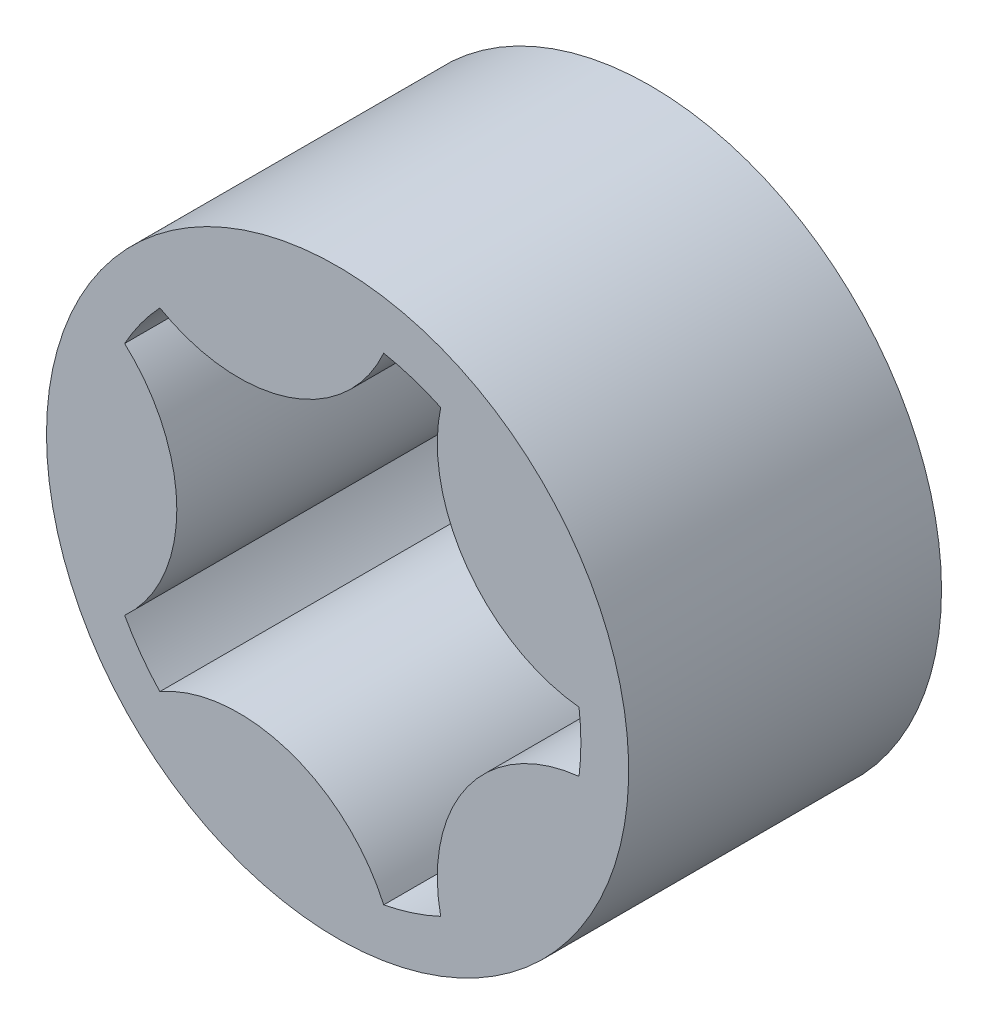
from build123d import *

# Parameters (mm, degrees)
SKETCH_1_R      = 33.5
EXTRUDE_1_DEPTH = 36


with BuildPart() as part:
    # Sketch 1 → Extrude 1 (new body)
    with BuildSketch(Plane.XY):
        with Locations(Location((0, 0, 0), (0, 0, 180))):
            Circle(SKETCH_1_R)
        with BuildLine():
            ThreePointArc((-20.454809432, 19.120689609), (-22.652475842, 16.457987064), (-24.505740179, 13.545061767))
            ThreePointArc((-24.505740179, 13.545061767), (-18.5, 0), (-24.505740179, -13.545061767))
            ThreePointArc((-24.505740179, -13.545061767), (-22.652475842, -16.457987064), (-20.454809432, -19.120689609))
            ThreePointArc((-20.454809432, -19.120689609), (-5.716814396, -17.594545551), (5.309429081, -27.49199816))
            ThreePointArc((5.309429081, -27.49199816), (8.652475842, -26.629582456), (11.863972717, -25.362297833))
            ThreePointArc((11.863972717, -25.362297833), (14.966814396, -10.874027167), (27.787147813, -3.445927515))
            ThreePointArc((27.787147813, -3.445927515), (28, 0), (27.787147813, 3.445927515))
            ThreePointArc((27.787147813, 3.445927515), (14.966814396, 10.874027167), (11.863972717, 25.362297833))
            ThreePointArc((11.863972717, 25.362297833), (8.652475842, 26.629582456), (5.309429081, 27.49199816))
            ThreePointArc((5.309429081, 27.49199816), (-5.716814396, 17.594545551), (-20.454809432, 19.120689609))
        make_face(mode=Mode.SUBTRACT)
    extrude(amount=EXTRUDE_1_DEPTH)


solid = part.part
